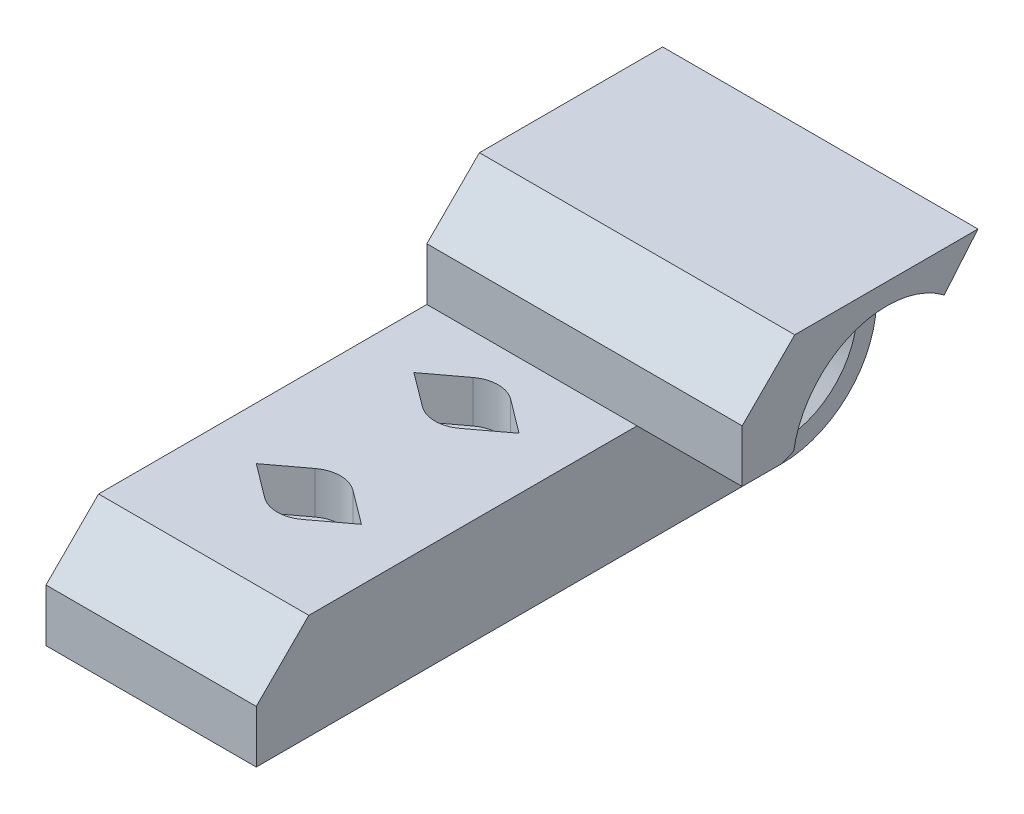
ISO-10303-21;
HEADER;
FILE_DESCRIPTION(('STEP AP214'),'2;1');
FILE_NAME('part.step','',(''),(''),'','','');
FILE_SCHEMA(('AUTOMOTIVE_DESIGN { 1 0 10303 214 1 1 1 1 }'));
ENDSEC;
DATA;
#1=APPLICATION_CONTEXT('core data for automotive mechanical design processes');
#2=APPLICATION_PROTOCOL_DEFINITION('international standard','automotive_design',2000,#1);
#3=PRODUCT_CONTEXT('',#1,'mechanical');
#4=PRODUCT('Part','Part','',(#3));
#5=PRODUCT_RELATED_PRODUCT_CATEGORY('part','',(#4));
#6=PRODUCT_DEFINITION_FORMATION('','',#4);
#7=PRODUCT_DEFINITION_CONTEXT('part definition',#1,'design');
#8=PRODUCT_DEFINITION('design','',#6,#7);
#9=PRODUCT_DEFINITION_SHAPE('','',#8);
#10=(LENGTH_UNIT() NAMED_UNIT(*) SI_UNIT(.MILLI.,.METRE.));
#11=(NAMED_UNIT(*) PLANE_ANGLE_UNIT() SI_UNIT($,.RADIAN.));
#12=(NAMED_UNIT(*) SI_UNIT($,.STERADIAN.) SOLID_ANGLE_UNIT());
#13=UNCERTAINTY_MEASURE_WITH_UNIT(LENGTH_MEASURE(1.E-05),#10,'distance_accuracy_value','');
#14=(GEOMETRIC_REPRESENTATION_CONTEXT(3) GLOBAL_UNCERTAINTY_ASSIGNED_CONTEXT((#13)) GLOBAL_UNIT_ASSIGNED_CONTEXT((#10,
#11,#12)) REPRESENTATION_CONTEXT('',''));
#15=CARTESIAN_POINT('',(0.,0.,0.));
#16=DIRECTION('',(0.,0.,1.));
#17=DIRECTION('',(1.,0.,0.));
#18=AXIS2_PLACEMENT_3D('',#15,#16,#17);
#19=CARTESIAN_POINT('',(-10.,6.,-30.));
#20=DIRECTION('',(0.,1.,0.));
#21=DIRECTION('',(0.,0.,1.));
#22=AXIS2_PLACEMENT_3D('',#19,#20,#21);
#23=CYLINDRICAL_SURFACE('',#22,3.);
#24=DIRECTION('',(0.,1.,0.));
#25=VECTOR('',#24,1.);
#26=CARTESIAN_POINT('',(-11.8,-5.6619037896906,-27.6));
#27=LINE('',#26,#25);
#28=CARTESIAN_POINT('',(-11.8,6.,-27.6));
#29=VERTEX_POINT('',#28);
#30=CARTESIAN_POINT('',(-11.8,10.,-27.6));
#31=VERTEX_POINT('',#30);
#32=EDGE_CURVE('E199',#29,#31,#27,.T.);
#33=ORIENTED_EDGE('',*,*,#32,.T.);
#34=CARTESIAN_POINT('',(-10.,10.,-30.));
#35=DIRECTION('',(0.,1.,0.));
#36=DIRECTION('',(0.,0.,1.));
#37=AXIS2_PLACEMENT_3D('',#34,#35,#36);
#38=CIRCLE('',#37,3.);
#39=CARTESIAN_POINT('',(-8.2,10.,-27.6));
#40=VERTEX_POINT('',#39);
#41=EDGE_CURVE('E214',#31,#40,#38,.T.);
#42=ORIENTED_EDGE('',*,*,#41,.T.);
#43=DIRECTION('',(0.,1.,0.));
#44=VECTOR('',#43,1.);
#45=CARTESIAN_POINT('',(-8.2,-5.6619037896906,-27.6));
#46=LINE('',#45,#44);
#47=CARTESIAN_POINT('',(-8.2,6.,-27.6));
#48=VERTEX_POINT('',#47);
#49=EDGE_CURVE('E217',#48,#40,#46,.T.);
#50=ORIENTED_EDGE('',*,*,#49,.F.);
#51=CARTESIAN_POINT('',(-10.,6.,-30.));
#52=DIRECTION('',(0.,1.,0.));
#53=DIRECTION('',(0.,0.,1.));
#54=AXIS2_PLACEMENT_3D('',#51,#52,#53);
#55=CIRCLE('',#54,3.);
#56=EDGE_CURVE('E216',#29,#48,#55,.T.);
#57=ORIENTED_EDGE('',*,*,#56,.F.);
#58=EDGE_LOOP('',(#33,#42,#50,#57));
#59=FACE_BOUND('',#58,.T.);
#60=ADVANCED_FACE('F38',(#59),#23,.F.);
#61=CARTESIAN_POINT('',(-8.20000000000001,10.,-32.4));
#62=VERTEX_POINT('',#61);
#63=CARTESIAN_POINT('',(-11.8,10.,-32.4));
#64=VERTEX_POINT('',#63);
#65=EDGE_CURVE('E225',#62,#64,#38,.T.);
#66=ORIENTED_EDGE('',*,*,#65,.T.);
#67=DIRECTION('',(0.,1.,0.));
#68=VECTOR('',#67,1.);
#69=CARTESIAN_POINT('',(-11.8,-5.6619037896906,-32.4));
#70=LINE('',#69,#68);
#71=CARTESIAN_POINT('',(-11.8,6.,-32.4));
#72=VERTEX_POINT('',#71);
#73=EDGE_CURVE('E476',#72,#64,#70,.T.);
#74=ORIENTED_EDGE('',*,*,#73,.F.);
#75=CARTESIAN_POINT('',(-8.2,6.,-32.4));
#76=VERTEX_POINT('',#75);
#77=EDGE_CURVE('E292',#76,#72,#55,.T.);
#78=ORIENTED_EDGE('',*,*,#77,.F.);
#79=DIRECTION('',(0.,1.,0.));
#80=VECTOR('',#79,1.);
#81=CARTESIAN_POINT('',(-8.20000000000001,-5.6619037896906,-32.4));
#82=LINE('',#81,#80);
#83=EDGE_CURVE('E485',#76,#62,#82,.T.);
#84=ORIENTED_EDGE('',*,*,#83,.T.);
#85=EDGE_LOOP('',(#66,#74,#78,#84));
#86=FACE_BOUND('',#85,.T.);
#87=ADVANCED_FACE('F362',(#86),#23,.F.);
#88=CARTESIAN_POINT('',(-10.,6.,-15.));
#89=DIRECTION('',(0.,1.,0.));
#90=DIRECTION('',(0.,0.,1.));
#91=AXIS2_PLACEMENT_3D('',#88,#89,#90);
#92=CYLINDRICAL_SURFACE('',#91,3.);
#93=DIRECTION('',(0.,1.,0.));
#94=VECTOR('',#93,1.);
#95=CARTESIAN_POINT('',(-8.2,-5.6619037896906,-17.4));
#96=LINE('',#95,#94);
#97=CARTESIAN_POINT('',(-8.2,6.,-17.4));
#98=VERTEX_POINT('',#97);
#99=CARTESIAN_POINT('',(-8.2,10.,-17.4));
#100=VERTEX_POINT('',#99);
#101=EDGE_CURVE('E509',#98,#100,#96,.T.);
#102=ORIENTED_EDGE('',*,*,#101,.T.);
#103=CARTESIAN_POINT('',(-10.,10.,-15.));
#104=DIRECTION('',(0.,1.,0.));
#105=DIRECTION('',(0.,0.,1.));
#106=AXIS2_PLACEMENT_3D('',#103,#104,#105);
#107=CIRCLE('',#106,3.);
#108=CARTESIAN_POINT('',(-11.8,10.,-17.4));
#109=VERTEX_POINT('',#108);
#110=EDGE_CURVE('E236',#100,#109,#107,.T.);
#111=ORIENTED_EDGE('',*,*,#110,.T.);
#112=DIRECTION('',(0.,1.,0.));
#113=VECTOR('',#112,1.);
#114=CARTESIAN_POINT('',(-11.8,-5.6619037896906,-17.4));
#115=LINE('',#114,#113);
#116=CARTESIAN_POINT('',(-11.8,6.,-17.4));
#117=VERTEX_POINT('',#116);
#118=EDGE_CURVE('E523',#117,#109,#115,.T.);
#119=ORIENTED_EDGE('',*,*,#118,.F.);
#120=CARTESIAN_POINT('',(-10.,6.,-15.));
#121=DIRECTION('',(0.,1.,0.));
#122=DIRECTION('',(0.,0.,1.));
#123=AXIS2_PLACEMENT_3D('',#120,#121,#122);
#124=CIRCLE('',#123,3.);
#125=EDGE_CURVE('E226',#98,#117,#124,.T.);
#126=ORIENTED_EDGE('',*,*,#125,.F.);
#127=EDGE_LOOP('',(#102,#111,#119,#126));
#128=FACE_BOUND('',#127,.T.);
#129=ADVANCED_FACE('F367',(#128),#92,.F.);
#130=CARTESIAN_POINT('',(-11.8,10.,-12.6));
#131=VERTEX_POINT('',#130);
#132=CARTESIAN_POINT('',(-8.2,10.,-12.6));
#133=VERTEX_POINT('',#132);
#134=EDGE_CURVE('E237',#131,#133,#107,.T.);
#135=ORIENTED_EDGE('',*,*,#134,.T.);
#136=DIRECTION('',(0.,1.,0.));
#137=VECTOR('',#136,1.);
#138=CARTESIAN_POINT('',(-8.2,-5.6619037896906,-12.6));
#139=LINE('',#138,#137);
#140=CARTESIAN_POINT('',(-8.2,6.,-12.6));
#141=VERTEX_POINT('',#140);
#142=EDGE_CURVE('E528',#141,#133,#139,.T.);
#143=ORIENTED_EDGE('',*,*,#142,.F.);
#144=CARTESIAN_POINT('',(-11.8,6.,-12.6));
#145=VERTEX_POINT('',#144);
#146=EDGE_CURVE('E230',#145,#141,#124,.T.);
#147=ORIENTED_EDGE('',*,*,#146,.F.);
#148=DIRECTION('',(0.,1.,0.));
#149=VECTOR('',#148,1.);
#150=CARTESIAN_POINT('',(-11.8,-5.6619037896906,-12.6));
#151=LINE('',#150,#149);
#152=EDGE_CURVE('E530',#145,#131,#151,.T.);
#153=ORIENTED_EDGE('',*,*,#152,.T.);
#154=EDGE_LOOP('',(#135,#143,#147,#153));
#155=FACE_BOUND('',#154,.T.);
#156=ADVANCED_FACE('F372',(#155),#92,.F.);
#157=CARTESIAN_POINT('',(-10.,-0.000999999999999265,-15.));
#158=DIRECTION('',(0.,1.,0.));
#159=DIRECTION('',(0.,0.,1.));
#160=AXIS2_PLACEMENT_3D('',#157,#158,#159);
#161=CYLINDRICAL_SURFACE('',#160,1.75);
#162=CARTESIAN_POINT('',(-10.,0.,-15.));
#163=DIRECTION('',(0.,-1.,0.));
#164=DIRECTION('',(0.,0.,-1.));
#165=AXIS2_PLACEMENT_3D('',#162,#163,#164);
#166=CIRCLE('',#165,1.75);
#167=CARTESIAN_POINT('',(-10.,0.,-16.75));
#168=VERTEX_POINT('',#167);
#169=EDGE_CURVE('E245',#168,#168,#166,.F.);
#170=ORIENTED_EDGE('',*,*,#169,.F.);
#171=EDGE_LOOP('',(#170));
#172=FACE_BOUND('',#171,.T.);
#173=CARTESIAN_POINT('',(-10.,6.,-15.));
#174=DIRECTION('',(0.,1.,0.));
#175=DIRECTION('',(0.,0.,1.));
#176=AXIS2_PLACEMENT_3D('',#173,#174,#175);
#177=CIRCLE('',#176,1.75);
#178=CARTESIAN_POINT('',(-10.,6.,-13.25));
#179=VERTEX_POINT('',#178);
#180=EDGE_CURVE('E248',#179,#179,#177,.F.);
#181=ORIENTED_EDGE('',*,*,#180,.F.);
#182=EDGE_LOOP('',(#181));
#183=FACE_BOUND('',#182,.T.);
#184=ADVANCED_FACE('F378',(#172,#183),#161,.F.);
#185=CARTESIAN_POINT('',(-10.,-0.000999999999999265,-30.));
#186=DIRECTION('',(0.,1.,0.));
#187=DIRECTION('',(0.,0.,1.));
#188=AXIS2_PLACEMENT_3D('',#185,#186,#187);
#189=CYLINDRICAL_SURFACE('',#188,1.75);
#190=CARTESIAN_POINT('',(-10.,0.,-30.));
#191=DIRECTION('',(0.,-1.,0.));
#192=DIRECTION('',(0.,0.,-1.));
#193=AXIS2_PLACEMENT_3D('',#190,#191,#192);
#194=CIRCLE('',#193,1.75);
#195=CARTESIAN_POINT('',(-10.,0.,-31.75));
#196=VERTEX_POINT('',#195);
#197=EDGE_CURVE('E241',#196,#196,#194,.F.);
#198=ORIENTED_EDGE('',*,*,#197,.F.);
#199=EDGE_LOOP('',(#198));
#200=FACE_BOUND('',#199,.T.);
#201=CARTESIAN_POINT('',(-10.,6.,-30.));
#202=DIRECTION('',(0.,1.,0.));
#203=DIRECTION('',(0.,0.,1.));
#204=AXIS2_PLACEMENT_3D('',#201,#202,#203);
#205=CIRCLE('',#204,1.75);
#206=CARTESIAN_POINT('',(-10.,6.,-28.25));
#207=VERTEX_POINT('',#206);
#208=EDGE_CURVE('E289',#207,#207,#205,.F.);
#209=ORIENTED_EDGE('',*,*,#208,.F.);
#210=EDGE_LOOP('',(#209));
#211=FACE_BOUND('',#210,.T.);
#212=ADVANCED_FACE('F374',(#200,#211),#189,.F.);
#213=CARTESIAN_POINT('',(-20.,5.,0.));
#214=DIRECTION('',(0.,0.,1.));
#215=DIRECTION('',(1.,0.,0.));
#216=AXIS2_PLACEMENT_3D('',#213,#214,#215);
#217=PLANE('',#216);
#218=DIRECTION('',(0.,-1.,0.));
#219=VECTOR('',#218,1.);
#220=CARTESIAN_POINT('',(0.,5.,0.));
#221=LINE('',#220,#219);
#222=CARTESIAN_POINT('',(0.,5.,0.));
#223=VERTEX_POINT('',#222);
#224=CARTESIAN_POINT('',(0.,0.,0.));
#225=VERTEX_POINT('',#224);
#226=EDGE_CURVE('E244',#223,#225,#221,.T.);
#227=ORIENTED_EDGE('',*,*,#226,.F.);
#228=DIRECTION('',(1.,0.,0.));
#229=VECTOR('',#228,1.);
#230=CARTESIAN_POINT('',(-20.,5.,0.));
#231=LINE('',#230,#229);
#232=CARTESIAN_POINT('',(-20.,5.,0.));
#233=VERTEX_POINT('',#232);
#234=EDGE_CURVE('E280',#233,#223,#231,.T.);
#235=ORIENTED_EDGE('',*,*,#234,.F.);
#236=DIRECTION('',(0.,-1.,0.));
#237=VECTOR('',#236,1.);
#238=CARTESIAN_POINT('',(-20.,5.,0.));
#239=LINE('',#238,#237);
#240=CARTESIAN_POINT('',(-20.,0.,0.));
#241=VERTEX_POINT('',#240);
#242=EDGE_CURVE('E249',#233,#241,#239,.T.);
#243=ORIENTED_EDGE('',*,*,#242,.T.);
#244=DIRECTION('',(1.,0.,0.));
#245=VECTOR('',#244,1.);
#246=CARTESIAN_POINT('',(-20.,0.,0.));
#247=LINE('',#246,#245);
#248=EDGE_CURVE('E264',#241,#225,#247,.T.);
#249=ORIENTED_EDGE('',*,*,#248,.T.);
#250=EDGE_LOOP('',(#227,#235,#243,#249));
#251=FACE_BOUND('',#250,.T.);
#252=ADVANCED_FACE('F377',(#251),#217,.T.);
#253=CARTESIAN_POINT('',(-20.,5.,0.));
#254=DIRECTION('',(0.,0.707106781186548,0.707106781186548));
#255=DIRECTION('',(0.,-0.707106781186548,0.707106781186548));
#256=AXIS2_PLACEMENT_3D('',#253,#254,#255);
#257=PLANE('',#256);
#258=DIRECTION('',(0.,-0.707106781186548,0.707106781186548));
#259=VECTOR('',#258,1.);
#260=CARTESIAN_POINT('',(0.,5.,0.));
#261=LINE('',#260,#259);
#262=CARTESIAN_POINT('',(0.,10.,-5.));
#263=VERTEX_POINT('',#262);
#264=EDGE_CURVE('E253',#263,#223,#261,.T.);
#265=ORIENTED_EDGE('',*,*,#264,.F.);
#266=DIRECTION('',(1.,0.,0.));
#267=VECTOR('',#266,1.);
#268=CARTESIAN_POINT('',(-20.,10.,-5.));
#269=LINE('',#268,#267);
#270=CARTESIAN_POINT('',(-20.,10.,-5.));
#271=VERTEX_POINT('',#270);
#272=EDGE_CURVE('E283',#271,#263,#269,.T.);
#273=ORIENTED_EDGE('',*,*,#272,.F.);
#274=DIRECTION('',(0.,-0.707106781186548,0.707106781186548));
#275=VECTOR('',#274,1.);
#276=CARTESIAN_POINT('',(-20.,5.,0.));
#277=LINE('',#276,#275);
#278=EDGE_CURVE('E261',#271,#233,#277,.T.);
#279=ORIENTED_EDGE('',*,*,#278,.T.);
#280=ORIENTED_EDGE('',*,*,#234,.T.);
#281=EDGE_LOOP('',(#265,#273,#279,#280));
#282=FACE_BOUND('',#281,.T.);
#283=ADVANCED_FACE('F390',(#282),#257,.T.);
#284=CARTESIAN_POINT('',(-20.,10.,-40.));
#285=DIRECTION('',(0.,1.,0.));
#286=DIRECTION('',(0.,0.,1.));
#287=AXIS2_PLACEMENT_3D('',#284,#285,#286);
#288=PLANE('',#287);
#289=DIRECTION('',(0.8,0.,0.6));
#290=VECTOR('',#289,1.);
#291=CARTESIAN_POINT('',(-15.,10.,-30.));
#292=LINE('',#291,#290);
#293=CARTESIAN_POINT('',(-15.,10.,-30.));
#294=VERTEX_POINT('',#293);
#295=EDGE_CURVE('E196',#294,#31,#292,.T.);
#296=ORIENTED_EDGE('',*,*,#295,.F.);
#297=DIRECTION('',(-0.8,0.,0.6));
#298=VECTOR('',#297,1.);
#299=CARTESIAN_POINT('',(-15.,10.,-30.));
#300=LINE('',#299,#298);
#301=EDGE_CURVE('E218',#64,#294,#300,.T.);
#302=ORIENTED_EDGE('',*,*,#301,.F.);
#303=ORIENTED_EDGE('',*,*,#65,.F.);
#304=DIRECTION('',(-0.800000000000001,0.,-0.599999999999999));
#305=VECTOR('',#304,1.);
#306=CARTESIAN_POINT('',(-5.,10.,-30.));
#307=LINE('',#306,#305);
#308=CARTESIAN_POINT('',(-5.,10.,-30.));
#309=VERTEX_POINT('',#308);
#310=EDGE_CURVE('E498',#309,#62,#307,.T.);
#311=ORIENTED_EDGE('',*,*,#310,.F.);
#312=DIRECTION('',(0.8,0.,-0.6));
#313=VECTOR('',#312,1.);
#314=CARTESIAN_POINT('',(-5.,10.,-30.));
#315=LINE('',#314,#313);
#316=EDGE_CURVE('E207',#40,#309,#315,.T.);
#317=ORIENTED_EDGE('',*,*,#316,.F.);
#318=ORIENTED_EDGE('',*,*,#41,.F.);
#319=EDGE_LOOP('',(#296,#302,#303,#311,#317,#318));
#320=FACE_BOUND('',#319,.T.);
#321=DIRECTION('',(-0.8,0.,-0.6));
#322=VECTOR('',#321,1.);
#323=CARTESIAN_POINT('',(-5.,10.,-15.));
#324=LINE('',#323,#322);
#325=CARTESIAN_POINT('',(-5.,10.,-15.));
#326=VERTEX_POINT('',#325);
#327=EDGE_CURVE('E521',#326,#100,#324,.T.);
#328=ORIENTED_EDGE('',*,*,#327,.F.);
#329=DIRECTION('',(0.800000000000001,0.,-0.599999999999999));
#330=VECTOR('',#329,1.);
#331=CARTESIAN_POINT('',(-5.,10.,-15.));
#332=LINE('',#331,#330);
#333=EDGE_CURVE('E518',#133,#326,#332,.T.);
#334=ORIENTED_EDGE('',*,*,#333,.F.);
#335=ORIENTED_EDGE('',*,*,#134,.F.);
#336=DIRECTION('',(0.8,0.,0.6));
#337=VECTOR('',#336,1.);
#338=CARTESIAN_POINT('',(-15.,10.,-15.));
#339=LINE('',#338,#337);
#340=CARTESIAN_POINT('',(-15.,10.,-15.));
#341=VERTEX_POINT('',#340);
#342=EDGE_CURVE('E516',#341,#131,#339,.T.);
#343=ORIENTED_EDGE('',*,*,#342,.F.);
#344=DIRECTION('',(-0.8,0.,0.6));
#345=VECTOR('',#344,1.);
#346=CARTESIAN_POINT('',(-15.,10.,-15.));
#347=LINE('',#346,#345);
#348=EDGE_CURVE('E513',#109,#341,#347,.T.);
#349=ORIENTED_EDGE('',*,*,#348,.F.);
#350=ORIENTED_EDGE('',*,*,#110,.F.);
#351=EDGE_LOOP('',(#328,#334,#335,#343,#349,#350));
#352=FACE_BOUND('',#351,.T.);
#353=DIRECTION('',(-1.,0.,0.));
#354=VECTOR('',#353,1.);
#355=CARTESIAN_POINT('',(10.,10.,-36.2250356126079));
#356=LINE('',#355,#354);
#357=CARTESIAN_POINT('',(0.,10.,-36.2250356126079));
#358=VERTEX_POINT('',#357);
#359=CARTESIAN_POINT('',(-20.,10.,-36.2250356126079));
#360=VERTEX_POINT('',#359);
#361=EDGE_CURVE('E332',#358,#360,#356,.T.);
#362=ORIENTED_EDGE('',*,*,#361,.T.);
#363=DIRECTION('',(0.,0.,1.));
#364=VECTOR('',#363,1.);
#365=CARTESIAN_POINT('',(-20.,10.,-40.));
#366=LINE('',#365,#364);
#367=EDGE_CURVE('E259',#360,#271,#366,.T.);
#368=ORIENTED_EDGE('',*,*,#367,.T.);
#369=ORIENTED_EDGE('',*,*,#272,.T.);
#370=DIRECTION('',(0.,0.,1.));
#371=VECTOR('',#370,1.);
#372=CARTESIAN_POINT('',(0.,10.,-40.));
#373=LINE('',#372,#371);
#374=EDGE_CURVE('E274',#358,#263,#373,.T.);
#375=ORIENTED_EDGE('',*,*,#374,.F.);
#376=EDGE_LOOP('',(#362,#368,#369,#375));
#377=FACE_BOUND('',#376,.T.);
#378=ADVANCED_FACE('F221',(#320,#352,#377),#288,.T.);
#379=CARTESIAN_POINT('',(-20.,9.,-50.));
#380=DIRECTION('',(1.,0.,0.));
#381=DIRECTION('',(0.,0.,-1.));
#382=AXIS2_PLACEMENT_3D('',#379,#380,#381);
#383=CYLINDRICAL_SURFACE('',#382,9.);
#384=DIRECTION('',(-1.,0.,0.));
#385=VECTOR('',#384,1.);
#386=CARTESIAN_POINT('',(10.,16.1697777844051,-55.4400630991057));
#387=LINE('',#386,#385);
#388=CARTESIAN_POINT('',(0.,16.1697777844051,-55.4400630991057));
#389=VERTEX_POINT('',#388);
#390=CARTESIAN_POINT('',(-20.,16.1697777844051,-55.4400630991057));
#391=VERTEX_POINT('',#390);
#392=EDGE_CURVE('E338',#389,#391,#387,.T.);
#393=ORIENTED_EDGE('',*,*,#392,.F.);
#394=CARTESIAN_POINT('',(0.,9.,-50.));
#395=DIRECTION('',(1.,0.,0.));
#396=DIRECTION('',(0.,0.,-1.));
#397=AXIS2_PLACEMENT_3D('',#394,#395,#396);
#398=CIRCLE('',#397,9.);
#399=CARTESIAN_POINT('',(0.,0.,-50.));
#400=VERTEX_POINT('',#399);
#401=EDGE_CURVE('E271',#400,#389,#398,.T.);
#402=ORIENTED_EDGE('',*,*,#401,.F.);
#403=DIRECTION('',(1.,0.,0.));
#404=VECTOR('',#403,1.);
#405=CARTESIAN_POINT('',(-20.,0.,-50.));
#406=LINE('',#405,#404);
#407=CARTESIAN_POINT('',(-20.,0.,-50.));
#408=VERTEX_POINT('',#407);
#409=EDGE_CURVE('E286',#408,#400,#406,.T.);
#410=ORIENTED_EDGE('',*,*,#409,.F.);
#411=CARTESIAN_POINT('',(-20.,9.,-50.));
#412=DIRECTION('',(1.,0.,0.));
#413=DIRECTION('',(0.,0.,-1.));
#414=AXIS2_PLACEMENT_3D('',#411,#412,#413);
#415=CIRCLE('',#414,9.);
#416=EDGE_CURVE('E256',#408,#391,#415,.T.);
#417=ORIENTED_EDGE('',*,*,#416,.T.);
#418=EDGE_LOOP('',(#393,#402,#410,#417));
#419=FACE_BOUND('',#418,.T.);
#420=ADVANCED_FACE('F396',(#419),#383,.T.);
#421=CARTESIAN_POINT('',(-20.,0.,0.));
#422=DIRECTION('',(0.,-1.,0.));
#423=DIRECTION('',(0.,0.,-1.));
#424=AXIS2_PLACEMENT_3D('',#421,#422,#423);
#425=PLANE('',#424);
#426=ORIENTED_EDGE('',*,*,#197,.T.);
#427=EDGE_LOOP('',(#426));
#428=FACE_BOUND('',#427,.T.);
#429=ORIENTED_EDGE('',*,*,#169,.T.);
#430=EDGE_LOOP('',(#429));
#431=FACE_BOUND('',#430,.T.);
#432=DIRECTION('',(0.,0.,-1.));
#433=VECTOR('',#432,1.);
#434=CARTESIAN_POINT('',(0.,0.,0.));
#435=LINE('',#434,#433);
#436=EDGE_CURVE('E267',#225,#400,#435,.T.);
#437=ORIENTED_EDGE('',*,*,#436,.F.);
#438=ORIENTED_EDGE('',*,*,#248,.F.);
#439=DIRECTION('',(0.,0.,-1.));
#440=VECTOR('',#439,1.);
#441=CARTESIAN_POINT('',(-20.,0.,0.));
#442=LINE('',#441,#440);
#443=EDGE_CURVE('E252',#241,#408,#442,.T.);
#444=ORIENTED_EDGE('',*,*,#443,.T.);
#445=ORIENTED_EDGE('',*,*,#409,.T.);
#446=EDGE_LOOP('',(#437,#438,#444,#445));
#447=FACE_BOUND('',#446,.T.);
#448=ADVANCED_FACE('F386',(#428,#431,#447),#425,.T.);
#449=CARTESIAN_POINT('',(-20.,9.,-50.));
#450=DIRECTION('',(1.,0.,0.));
#451=DIRECTION('',(0.,0.,-1.));
#452=AXIS2_PLACEMENT_3D('',#449,#450,#451);
#453=PLANE('',#452);
#454=DIRECTION('',(0.,1.,0.));
#455=VECTOR('',#454,1.);
#456=CARTESIAN_POINT('',(-20.,10.,-36.2250356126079));
#457=LINE('',#456,#455);
#458=CARTESIAN_POINT('',(-20.,15.,-36.2250356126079));
#459=VERTEX_POINT('',#458);
#460=EDGE_CURVE('E307',#360,#459,#457,.T.);
#461=ORIENTED_EDGE('',*,*,#460,.T.);
#462=DIRECTION('',(0.,-0.707106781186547,0.707106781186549));
#463=VECTOR('',#462,1.);
#464=CARTESIAN_POINT('',(-20.,15.,-36.2250356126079));
#465=LINE('',#464,#463);
#466=CARTESIAN_POINT('',(-20.,20.,-41.2250356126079));
#467=VERTEX_POINT('',#466);
#468=EDGE_CURVE('E60',#459,#467,#465,.F.);
#469=ORIENTED_EDGE('',*,*,#468,.T.);
#470=DIRECTION('',(0.,0.,-1.));
#471=VECTOR('',#470,1.);
#472=CARTESIAN_POINT('',(-20.,20.,-36.2250356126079));
#473=LINE('',#472,#471);
#474=CARTESIAN_POINT('',(-20.,20.,-58.6540011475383));
#475=VERTEX_POINT('',#474);
#476=EDGE_CURVE('E316',#467,#475,#473,.T.);
#477=ORIENTED_EDGE('',*,*,#476,.T.);
#478=DIRECTION('',(0.,-0.766044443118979,0.642787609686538));
#479=VECTOR('',#478,1.);
#480=CARTESIAN_POINT('',(-20.,20.,-58.6540011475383));
#481=LINE('',#480,#479);
#482=EDGE_CURVE('E319',#475,#391,#481,.T.);
#483=ORIENTED_EDGE('',*,*,#482,.T.);
#484=ORIENTED_EDGE('',*,*,#416,.F.);
#485=ORIENTED_EDGE('',*,*,#443,.F.);
#486=ORIENTED_EDGE('',*,*,#242,.F.);
#487=ORIENTED_EDGE('',*,*,#278,.F.);
#488=ORIENTED_EDGE('',*,*,#367,.F.);
#489=EDGE_LOOP('',(#461,#469,#477,#483,#484,#485,#486,#487,#488));
#490=FACE_BOUND('',#489,.T.);
#491=ADVANCED_FACE('F314',(#490),#453,.F.);
#492=CARTESIAN_POINT('',(0.,9.,-50.));
#493=DIRECTION('',(1.,0.,0.));
#494=DIRECTION('',(0.,0.,-1.));
#495=AXIS2_PLACEMENT_3D('',#492,#493,#494);
#496=PLANE('',#495);
#497=DIRECTION('',(0.,0.378041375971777,-0.925788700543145));
#498=VECTOR('',#497,1.);
#499=CARTESIAN_POINT('',(0.,10.,-40.));
#500=LINE('',#499,#498);
#501=CARTESIAN_POINT('',(0.,10.,-40.));
#502=VERTEX_POINT('',#501);
#503=CARTESIAN_POINT('',(0.,10.4568108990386,-41.1186880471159));
#504=VERTEX_POINT('',#503);
#505=EDGE_CURVE('E317',#502,#504,#500,.T.);
#506=ORIENTED_EDGE('',*,*,#505,.F.);
#507=EDGE_CURVE('E275',#502,#358,#373,.T.);
#508=ORIENTED_EDGE('',*,*,#507,.T.);
#509=ORIENTED_EDGE('',*,*,#374,.T.);
#510=ORIENTED_EDGE('',*,*,#264,.T.);
#511=ORIENTED_EDGE('',*,*,#226,.T.);
#512=ORIENTED_EDGE('',*,*,#436,.T.);
#513=ORIENTED_EDGE('',*,*,#401,.T.);
#514=EDGE_CURVE('E270',#389,#504,#398,.T.);
#515=ORIENTED_EDGE('',*,*,#514,.T.);
#516=EDGE_LOOP('',(#506,#508,#509,#510,#511,#512,#513,#515));
#517=FACE_BOUND('',#516,.T.);
#518=CARTESIAN_POINT('',(0.,9.,-50.));
#519=DIRECTION('',(1.,0.,0.));
#520=DIRECTION('',(0.,0.,-1.));
#521=AXIS2_PLACEMENT_3D('',#518,#519,#520);
#522=CIRCLE('',#521,7.15000000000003);
#523=CARTESIAN_POINT('',(0.,9.,-57.15));
#524=VERTEX_POINT('',#523);
#525=EDGE_CURVE('E297',#524,#524,#522,.F.);
#526=ORIENTED_EDGE('',*,*,#525,.T.);
#527=EDGE_LOOP('',(#526));
#528=FACE_BOUND('',#527,.T.);
#529=ADVANCED_FACE('F385',(#517,#528),#496,.T.);
#530=CARTESIAN_POINT('',(-10.,6.,-30.));
#531=DIRECTION('',(0.,1.,0.));
#532=DIRECTION('',(0.,0.,1.));
#533=AXIS2_PLACEMENT_3D('',#530,#531,#532);
#534=PLANE('',#533);
#535=ORIENTED_EDGE('',*,*,#56,.T.);
#536=DIRECTION('',(-0.8,0.,0.6));
#537=VECTOR('',#536,1.);
#538=CARTESIAN_POINT('',(-5.,6.,-30.));
#539=LINE('',#538,#537);
#540=CARTESIAN_POINT('',(-5.,6.,-30.));
#541=VERTEX_POINT('',#540);
#542=EDGE_CURVE('E490',#541,#48,#539,.T.);
#543=ORIENTED_EDGE('',*,*,#542,.F.);
#544=DIRECTION('',(0.800000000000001,0.,0.599999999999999));
#545=VECTOR('',#544,1.);
#546=CARTESIAN_POINT('',(-5.,6.,-30.));
#547=LINE('',#546,#545);
#548=EDGE_CURVE('E480',#76,#541,#547,.T.);
#549=ORIENTED_EDGE('',*,*,#548,.F.);
#550=ORIENTED_EDGE('',*,*,#77,.T.);
#551=DIRECTION('',(0.8,0.,-0.6));
#552=VECTOR('',#551,1.);
#553=CARTESIAN_POINT('',(-15.,6.,-30.));
#554=LINE('',#553,#552);
#555=CARTESIAN_POINT('',(-15.,6.,-30.));
#556=VERTEX_POINT('',#555);
#557=EDGE_CURVE('E474',#556,#72,#554,.T.);
#558=ORIENTED_EDGE('',*,*,#557,.F.);
#559=DIRECTION('',(-0.8,0.,-0.6));
#560=VECTOR('',#559,1.);
#561=CARTESIAN_POINT('',(-15.,6.,-30.));
#562=LINE('',#561,#560);
#563=EDGE_CURVE('E479',#29,#556,#562,.T.);
#564=ORIENTED_EDGE('',*,*,#563,.F.);
#565=EDGE_LOOP('',(#535,#543,#549,#550,#558,#564));
#566=FACE_BOUND('',#565,.T.);
#567=ORIENTED_EDGE('',*,*,#208,.T.);
#568=EDGE_LOOP('',(#567));
#569=FACE_BOUND('',#568,.T.);
#570=ADVANCED_FACE('F357',(#566,#569),#534,.T.);
#571=CARTESIAN_POINT('',(-10.,6.,-15.));
#572=DIRECTION('',(0.,1.,0.));
#573=DIRECTION('',(0.,0.,1.));
#574=AXIS2_PLACEMENT_3D('',#571,#572,#573);
#575=PLANE('',#574);
#576=ORIENTED_EDGE('',*,*,#146,.T.);
#577=DIRECTION('',(-0.800000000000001,0.,0.599999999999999));
#578=VECTOR('',#577,1.);
#579=CARTESIAN_POINT('',(-5.,6.,-15.));
#580=LINE('',#579,#578);
#581=CARTESIAN_POINT('',(-5.,6.,-15.));
#582=VERTEX_POINT('',#581);
#583=EDGE_CURVE('E508',#582,#141,#580,.T.);
#584=ORIENTED_EDGE('',*,*,#583,.F.);
#585=DIRECTION('',(0.8,0.,0.6));
#586=VECTOR('',#585,1.);
#587=CARTESIAN_POINT('',(-5.,6.,-15.));
#588=LINE('',#587,#586);
#589=EDGE_CURVE('E511',#98,#582,#588,.T.);
#590=ORIENTED_EDGE('',*,*,#589,.F.);
#591=ORIENTED_EDGE('',*,*,#125,.T.);
#592=DIRECTION('',(0.8,0.,-0.6));
#593=VECTOR('',#592,1.);
#594=CARTESIAN_POINT('',(-15.,6.,-15.));
#595=LINE('',#594,#593);
#596=CARTESIAN_POINT('',(-15.,6.,-15.));
#597=VERTEX_POINT('',#596);
#598=EDGE_CURVE('E208',#597,#117,#595,.T.);
#599=ORIENTED_EDGE('',*,*,#598,.F.);
#600=DIRECTION('',(-0.8,0.,-0.6));
#601=VECTOR('',#600,1.);
#602=CARTESIAN_POINT('',(-15.,6.,-15.));
#603=LINE('',#602,#601);
#604=EDGE_CURVE('E506',#145,#597,#603,.T.);
#605=ORIENTED_EDGE('',*,*,#604,.F.);
#606=EDGE_LOOP('',(#576,#584,#590,#591,#599,#605));
#607=FACE_BOUND('',#606,.T.);
#608=ORIENTED_EDGE('',*,*,#180,.T.);
#609=EDGE_LOOP('',(#608));
#610=FACE_BOUND('',#609,.T.);
#611=ADVANCED_FACE('F348',(#607,#610),#575,.T.);
#612=CARTESIAN_POINT('',(-13.,9.,-50.));
#613=DIRECTION('',(1.,0.,0.));
#614=DIRECTION('',(0.,0.,-1.));
#615=AXIS2_PLACEMENT_3D('',#612,#613,#614);
#616=CYLINDRICAL_SURFACE('',#615,6.14999999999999);
#617=CARTESIAN_POINT('',(-1.00000000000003,9.,-50.));
#618=DIRECTION('',(1.,0.,0.));
#619=DIRECTION('',(0.,0.,-1.));
#620=AXIS2_PLACEMENT_3D('',#617,#618,#619);
#621=CIRCLE('',#620,6.14999999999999);
#622=CARTESIAN_POINT('',(-1.00000000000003,9.,-56.15));
#623=VERTEX_POINT('',#622);
#624=EDGE_CURVE('E282',#623,#623,#621,.T.);
#625=CARTESIAN_POINT('',(-13.,9.,-50.));
#626=DIRECTION('',(1.,0.,0.));
#627=DIRECTION('',(0.,0.,-1.));
#628=AXIS2_PLACEMENT_3D('',#625,#626,#627);
#629=CIRCLE('',#628,6.14999999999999);
#630=CARTESIAN_POINT('',(-13.,9.,-56.15));
#631=VERTEX_POINT('',#630);
#632=EDGE_CURVE('E240',#631,#631,#629,.T.);
#633=CARTESIAN_POINT('',(-1.00000000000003,9.,-56.15));
#634=CARTESIAN_POINT('',(-1.12500000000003,9.,-56.15));
#635=CARTESIAN_POINT('',(-1.25000000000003,9.,-56.15));
#636=CARTESIAN_POINT('',(-1.50000000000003,9.,-56.15));
#637=CARTESIAN_POINT('',(-1.62500000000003,9.,-56.15));
#638=CARTESIAN_POINT('',(-1.87500000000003,9.,-56.15));
#639=CARTESIAN_POINT('',(-2.00000000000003,9.,-56.15));
#640=CARTESIAN_POINT('',(-2.25000000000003,9.,-56.15));
#641=CARTESIAN_POINT('',(-2.37500000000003,9.,-56.15));
#642=CARTESIAN_POINT('',(-2.62500000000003,9.,-56.15));
#643=CARTESIAN_POINT('',(-2.75000000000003,9.,-56.15));
#644=CARTESIAN_POINT('',(-3.00000000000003,9.,-56.15));
#645=CARTESIAN_POINT('',(-3.12500000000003,9.,-56.15));
#646=CARTESIAN_POINT('',(-3.37500000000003,9.,-56.15));
#647=CARTESIAN_POINT('',(-3.50000000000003,9.,-56.15));
#648=CARTESIAN_POINT('',(-3.75000000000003,9.,-56.15));
#649=CARTESIAN_POINT('',(-3.87500000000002,9.,-56.15));
#650=CARTESIAN_POINT('',(-4.12500000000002,9.,-56.15));
#651=CARTESIAN_POINT('',(-4.25000000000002,9.,-56.15));
#652=CARTESIAN_POINT('',(-4.50000000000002,9.,-56.15));
#653=CARTESIAN_POINT('',(-4.62500000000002,9.,-56.15));
#654=CARTESIAN_POINT('',(-4.87500000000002,9.,-56.15));
#655=CARTESIAN_POINT('',(-5.00000000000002,9.,-56.15));
#656=CARTESIAN_POINT('',(-5.25000000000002,9.,-56.15));
#657=CARTESIAN_POINT('',(-5.37500000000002,9.,-56.15));
#658=CARTESIAN_POINT('',(-5.62500000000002,9.,-56.15));
#659=CARTESIAN_POINT('',(-5.75000000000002,9.,-56.15));
#660=CARTESIAN_POINT('',(-6.00000000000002,9.,-56.15));
#661=CARTESIAN_POINT('',(-6.12500000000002,9.,-56.15));
#662=CARTESIAN_POINT('',(-6.37500000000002,9.,-56.15));
#663=CARTESIAN_POINT('',(-6.50000000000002,9.,-56.15));
#664=CARTESIAN_POINT('',(-6.75000000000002,9.,-56.15));
#665=CARTESIAN_POINT('',(-6.87500000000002,9.,-56.15));
#666=CARTESIAN_POINT('',(-7.12500000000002,9.,-56.15));
#667=CARTESIAN_POINT('',(-7.25000000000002,9.,-56.15));
#668=CARTESIAN_POINT('',(-7.50000000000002,9.,-56.15));
#669=CARTESIAN_POINT('',(-7.62500000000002,9.,-56.15));
#670=CARTESIAN_POINT('',(-7.87500000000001,9.,-56.15));
#671=CARTESIAN_POINT('',(-8.00000000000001,9.,-56.15));
#672=CARTESIAN_POINT('',(-8.25000000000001,9.,-56.15));
#673=CARTESIAN_POINT('',(-8.37500000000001,9.,-56.15));
#674=CARTESIAN_POINT('',(-8.62500000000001,9.,-56.15));
#675=CARTESIAN_POINT('',(-8.75000000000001,9.,-56.15));
#676=CARTESIAN_POINT('',(-9.00000000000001,9.,-56.15));
#677=CARTESIAN_POINT('',(-9.12500000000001,9.,-56.15));
#678=CARTESIAN_POINT('',(-9.37500000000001,9.,-56.15));
#679=CARTESIAN_POINT('',(-9.50000000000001,9.,-56.15));
#680=CARTESIAN_POINT('',(-9.75000000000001,9.,-56.15));
#681=CARTESIAN_POINT('',(-9.87500000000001,9.,-56.15));
#682=CARTESIAN_POINT('',(-10.125,9.,-56.15));
#683=CARTESIAN_POINT('',(-10.25,9.,-56.15));
#684=CARTESIAN_POINT('',(-10.5,9.,-56.15));
#685=CARTESIAN_POINT('',(-10.625,9.,-56.15));
#686=CARTESIAN_POINT('',(-10.875,9.,-56.15));
#687=CARTESIAN_POINT('',(-11.,9.,-56.15));
#688=CARTESIAN_POINT('',(-11.25,9.,-56.15));
#689=CARTESIAN_POINT('',(-11.375,9.,-56.15));
#690=CARTESIAN_POINT('',(-11.625,9.,-56.15));
#691=CARTESIAN_POINT('',(-11.75,9.,-56.15));
#692=CARTESIAN_POINT('',(-12.,9.,-56.15));
#693=CARTESIAN_POINT('',(-12.125,9.,-56.15));
#694=CARTESIAN_POINT('',(-12.375,9.,-56.15));
#695=CARTESIAN_POINT('',(-12.5,9.,-56.15));
#696=CARTESIAN_POINT('',(-12.75,9.,-56.15));
#697=CARTESIAN_POINT('',(-12.875,9.,-56.15));
#698=CARTESIAN_POINT('',(-13.,9.,-56.15));
#699=B_SPLINE_CURVE_WITH_KNOTS('',3,(#633,#634,#635,#636,#637,#638,#639,#640,#641,#642,#643,
#644,#645,#646,#647,#648,#649,#650,#651,#652,#653,#654,#655,#656,#657,#658,#659,#660,#661,#662,
#663,#664,#665,#666,#667,#668,#669,#670,#671,#672,#673,#674,#675,#676,#677,#678,#679,#680,#681,
#682,#683,#684,#685,#686,#687,#688,#689,#690,#691,#692,#693,#694,#695,#696,#697,#698),
.UNSPECIFIED.,.F.,.F.,(4,2,2,2,2,2,2,2,2,2,2,2,2,2,2,2,2,2,2,2,2,2,2,2,2,2,2,2,2,2,2,2,4),(0.,
0.374999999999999,0.749999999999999,1.125,1.5,1.87499999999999,2.25,2.62499999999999,
2.99999999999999,3.37499999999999,3.74999999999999,4.12499999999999,4.49999999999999,
4.87499999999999,5.24999999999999,5.62499999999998,5.99999999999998,6.37499999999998,
6.74999999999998,7.12499999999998,7.49999999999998,7.87499999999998,8.24999999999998,
8.62499999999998,8.99999999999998,9.37499999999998,9.74999999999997,10.125,10.5,10.875,11.25,
11.625,12.),.UNSPECIFIED.);
#700=EDGE_CURVE('BSEAM346',#623,#631,#699,.T.);
#701=ORIENTED_EDGE('',*,*,#624,.T.);
#702=ORIENTED_EDGE('',*,*,#632,.F.);
#703=ORIENTED_EDGE('',*,*,#700,.T.);
#704=ORIENTED_EDGE('',*,*,#700,.F.);
#705=EDGE_LOOP('',(#701,#703,#702,#704));
#706=FACE_BOUND('',#705,.T.);
#707=ADVANCED_FACE('F346',(#706),#616,.F.);
#708=CARTESIAN_POINT('',(-13.,9.,-50.));
#709=DIRECTION('',(1.,0.,0.));
#710=DIRECTION('',(0.,0.,-1.));
#711=AXIS2_PLACEMENT_3D('',#708,#709,#710);
#712=PLANE('',#711);
#713=ORIENTED_EDGE('',*,*,#632,.T.);
#714=EDGE_LOOP('',(#713));
#715=FACE_BOUND('',#714,.T.);
#716=ADVANCED_FACE('F344',(#715),#712,.T.);
#717=CARTESIAN_POINT('',(-1.00000000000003,9.,-50.));
#718=DIRECTION('',(1.,0.,0.));
#719=DIRECTION('',(0.,0.,-1.));
#720=AXIS2_PLACEMENT_3D('',#717,#718,#719);
#721=CONICAL_SURFACE('',#720,6.14999999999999,0.785398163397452);
#722=ORIENTED_EDGE('',*,*,#525,.F.);
#723=EDGE_LOOP('',(#722));
#724=FACE_BOUND('',#723,.T.);
#725=ORIENTED_EDGE('',*,*,#624,.F.);
#726=EDGE_LOOP('',(#725));
#727=FACE_BOUND('',#726,.T.);
#728=ADVANCED_FACE('F355',(#724,#727),#721,.F.);
#729=CARTESIAN_POINT('',(10.,10.,-36.2250356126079));
#730=DIRECTION('',(0.,0.,1.));
#731=DIRECTION('',(1.,0.,0.));
#732=AXIS2_PLACEMENT_3D('',#729,#730,#731);
#733=PLANE('',#732);
#734=DIRECTION('',(0.,1.,0.));
#735=VECTOR('',#734,1.);
#736=CARTESIAN_POINT('',(10.,10.,-36.2250356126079));
#737=LINE('',#736,#735);
#738=CARTESIAN_POINT('',(10.,10.,-36.2250356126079));
#739=VERTEX_POINT('',#738);
#740=CARTESIAN_POINT('',(10.,15.,-36.2250356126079));
#741=VERTEX_POINT('',#740);
#742=EDGE_CURVE('E310',#739,#741,#737,.T.);
#743=ORIENTED_EDGE('',*,*,#742,.T.);
#744=DIRECTION('',(-1.,0.,0.));
#745=VECTOR('',#744,1.);
#746=CARTESIAN_POINT('',(10.,15.,-36.2250356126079));
#747=LINE('',#746,#745);
#748=EDGE_CURVE('E300',#741,#459,#747,.T.);
#749=ORIENTED_EDGE('',*,*,#748,.T.);
#750=ORIENTED_EDGE('',*,*,#460,.F.);
#751=ORIENTED_EDGE('',*,*,#361,.F.);
#752=EDGE_CURVE('E329',#739,#358,#356,.T.);
#753=ORIENTED_EDGE('',*,*,#752,.F.);
#754=EDGE_LOOP('',(#743,#749,#750,#751,#753));
#755=FACE_BOUND('',#754,.T.);
#756=ADVANCED_FACE('F306',(#755),#733,.T.);
#757=CARTESIAN_POINT('',(10.,10.,-40.));
#758=DIRECTION('',(0.,-1.,0.));
#759=DIRECTION('',(0.,0.,-1.));
#760=AXIS2_PLACEMENT_3D('',#757,#758,#759);
#761=PLANE('',#760);
#762=ORIENTED_EDGE('',*,*,#752,.T.);
#763=ORIENTED_EDGE('',*,*,#507,.F.);
#764=DIRECTION('',(-1.,0.,0.));
#765=VECTOR('',#764,1.);
#766=CARTESIAN_POINT('',(10.,10.,-40.));
#767=LINE('',#766,#765);
#768=CARTESIAN_POINT('',(10.,10.,-40.));
#769=VERTEX_POINT('',#768);
#770=EDGE_CURVE('E333',#769,#502,#767,.T.);
#771=ORIENTED_EDGE('',*,*,#770,.F.);
#772=DIRECTION('',(0.,0.,1.));
#773=VECTOR('',#772,1.);
#774=CARTESIAN_POINT('',(10.,10.,-40.));
#775=LINE('',#774,#773);
#776=EDGE_CURVE('E324',#769,#739,#775,.T.);
#777=ORIENTED_EDGE('',*,*,#776,.T.);
#778=EDGE_LOOP('',(#762,#763,#771,#777));
#779=FACE_BOUND('',#778,.T.);
#780=ADVANCED_FACE('F410',(#779),#761,.T.);
#781=CARTESIAN_POINT('',(10.,9.,-50.));
#782=DIRECTION('',(-1.,0.,0.));
#783=DIRECTION('',(0.,0.,1.));
#784=AXIS2_PLACEMENT_3D('',#781,#782,#783);
#785=CYLINDRICAL_SURFACE('',#784,9.);
#786=DIRECTION('',(1.,0.,0.));
#787=VECTOR('',#786,1.);
#788=CARTESIAN_POINT('',(-3.6674587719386,10.4568108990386,-41.1186880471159));
#789=LINE('',#788,#787);
#790=CARTESIAN_POINT('',(10.,10.4568108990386,-41.1186880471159));
#791=VERTEX_POINT('',#790);
#792=EDGE_CURVE('E321',#504,#791,#789,.T.);
#793=ORIENTED_EDGE('',*,*,#792,.F.);
#794=ORIENTED_EDGE('',*,*,#514,.F.);
#795=CARTESIAN_POINT('',(10.,16.1697777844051,-55.4400630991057));
#796=VERTEX_POINT('',#795);
#797=EDGE_CURVE('E335',#796,#389,#387,.T.);
#798=ORIENTED_EDGE('',*,*,#797,.F.);
#799=CARTESIAN_POINT('',(10.,9.,-50.));
#800=DIRECTION('',(1.,0.,0.));
#801=DIRECTION('',(0.,0.,1.));
#802=AXIS2_PLACEMENT_3D('',#799,#800,#801);
#803=CIRCLE('',#802,9.);
#804=EDGE_CURVE('E543',#796,#791,#803,.T.);
#805=ORIENTED_EDGE('',*,*,#804,.T.);
#806=EDGE_LOOP('',(#793,#794,#798,#805));
#807=FACE_BOUND('',#806,.T.);
#808=ADVANCED_FACE('F419',(#807),#785,.F.);
#809=CARTESIAN_POINT('',(10.,20.,-58.6540011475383));
#810=DIRECTION('',(0.,-0.642787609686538,-0.766044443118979));
#811=DIRECTION('',(0.,0.766044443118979,-0.642787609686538));
#812=AXIS2_PLACEMENT_3D('',#809,#810,#811);
#813=PLANE('',#812);
#814=ORIENTED_EDGE('',*,*,#482,.F.);
#815=DIRECTION('',(-1.,0.,0.));
#816=VECTOR('',#815,1.);
#817=CARTESIAN_POINT('',(10.,20.,-58.6540011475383));
#818=LINE('',#817,#816);
#819=CARTESIAN_POINT('',(10.,20.,-58.6540011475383));
#820=VERTEX_POINT('',#819);
#821=EDGE_CURVE('E339',#820,#475,#818,.T.);
#822=ORIENTED_EDGE('',*,*,#821,.F.);
#823=DIRECTION('',(0.,-0.766044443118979,0.642787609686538));
#824=VECTOR('',#823,1.);
#825=CARTESIAN_POINT('',(10.,20.,-58.6540011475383));
#826=LINE('',#825,#824);
#827=EDGE_CURVE('E541',#820,#796,#826,.T.);
#828=ORIENTED_EDGE('',*,*,#827,.T.);
#829=ORIENTED_EDGE('',*,*,#797,.T.);
#830=ORIENTED_EDGE('',*,*,#392,.T.);
#831=EDGE_LOOP('',(#814,#822,#828,#829,#830));
#832=FACE_BOUND('',#831,.T.);
#833=ADVANCED_FACE('F427',(#832),#813,.T.);
#834=CARTESIAN_POINT('',(10.,20.,-36.2250356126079));
#835=DIRECTION('',(0.,1.,0.));
#836=DIRECTION('',(0.,0.,1.));
#837=AXIS2_PLACEMENT_3D('',#834,#835,#836);
#838=PLANE('',#837);
#839=ORIENTED_EDGE('',*,*,#476,.F.);
#840=DIRECTION('',(1.,0.,0.));
#841=VECTOR('',#840,1.);
#842=CARTESIAN_POINT('',(10.,20.,-41.2250356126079));
#843=LINE('',#842,#841);
#844=CARTESIAN_POINT('',(10.,20.,-41.2250356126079));
#845=VERTEX_POINT('',#844);
#846=EDGE_CURVE('E46',#467,#845,#843,.T.);
#847=ORIENTED_EDGE('',*,*,#846,.T.);
#848=DIRECTION('',(0.,0.,-1.));
#849=VECTOR('',#848,1.);
#850=CARTESIAN_POINT('',(10.,20.,-36.2250356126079));
#851=LINE('',#850,#849);
#852=EDGE_CURVE('E539',#845,#820,#851,.T.);
#853=ORIENTED_EDGE('',*,*,#852,.T.);
#854=ORIENTED_EDGE('',*,*,#821,.T.);
#855=EDGE_LOOP('',(#839,#847,#853,#854));
#856=FACE_BOUND('',#855,.T.);
#857=ADVANCED_FACE('F423',(#856),#838,.T.);
#858=CARTESIAN_POINT('',(10.,9.,-50.));
#859=DIRECTION('',(-1.,0.,0.));
#860=DIRECTION('',(0.,0.,1.));
#861=AXIS2_PLACEMENT_3D('',#858,#859,#860);
#862=PLANE('',#861);
#863=ORIENTED_EDGE('',*,*,#852,.F.);
#864=DIRECTION('',(0.,0.707106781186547,-0.707106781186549));
#865=VECTOR('',#864,1.);
#866=CARTESIAN_POINT('',(10.,15.,-36.2250356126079));
#867=LINE('',#866,#865);
#868=EDGE_CURVE('E11',#845,#741,#867,.F.);
#869=ORIENTED_EDGE('',*,*,#868,.T.);
#870=ORIENTED_EDGE('',*,*,#742,.F.);
#871=ORIENTED_EDGE('',*,*,#776,.F.);
#872=DIRECTION('',(0.,-0.378041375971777,0.925788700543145));
#873=VECTOR('',#872,1.);
#874=CARTESIAN_POINT('',(10.,10.,-40.));
#875=LINE('',#874,#873);
#876=EDGE_CURVE('E492',#791,#769,#875,.T.);
#877=ORIENTED_EDGE('',*,*,#876,.F.);
#878=ORIENTED_EDGE('',*,*,#804,.F.);
#879=ORIENTED_EDGE('',*,*,#827,.F.);
#880=EDGE_LOOP('',(#863,#869,#870,#871,#877,#878,#879));
#881=FACE_BOUND('',#880,.T.);
#882=ADVANCED_FACE('F426',(#881),#862,.F.);
#883=CARTESIAN_POINT('',(-3.6674587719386,10.,-40.));
#884=DIRECTION('',(0.,0.925788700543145,0.378041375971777));
#885=DIRECTION('',(0.,-0.378041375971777,0.925788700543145));
#886=AXIS2_PLACEMENT_3D('',#883,#884,#885);
#887=PLANE('',#886);
#888=ORIENTED_EDGE('',*,*,#505,.T.);
#889=ORIENTED_EDGE('',*,*,#792,.T.);
#890=ORIENTED_EDGE('',*,*,#876,.T.);
#891=ORIENTED_EDGE('',*,*,#770,.T.);
#892=EDGE_LOOP('',(#888,#889,#890,#891));
#893=FACE_BOUND('',#892,.T.);
#894=ADVANCED_FACE('F436',(#893),#887,.F.);
#895=CARTESIAN_POINT('',(-5.,-5.6619037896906,-15.));
#896=DIRECTION('',(0.599999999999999,0.,0.800000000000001));
#897=DIRECTION('',(0.800000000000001,0.,-0.599999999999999));
#898=AXIS2_PLACEMENT_3D('',#895,#896,#897);
#899=PLANE('',#898);
#900=ORIENTED_EDGE('',*,*,#583,.T.);
#901=ORIENTED_EDGE('',*,*,#142,.T.);
#902=ORIENTED_EDGE('',*,*,#333,.T.);
#903=DIRECTION('',(0.,1.,0.));
#904=VECTOR('',#903,1.);
#905=CARTESIAN_POINT('',(-5.,-5.6619037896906,-15.));
#906=LINE('',#905,#904);
#907=EDGE_CURVE('E526',#582,#326,#906,.T.);
#908=ORIENTED_EDGE('',*,*,#907,.F.);
#909=EDGE_LOOP('',(#900,#901,#902,#908));
#910=FACE_BOUND('',#909,.T.);
#911=ADVANCED_FACE('F440',(#910),#899,.F.);
#912=CARTESIAN_POINT('',(-5.,-5.6619037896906,-15.));
#913=DIRECTION('',(0.6,0.,-0.8));
#914=DIRECTION('',(-0.8,0.,-0.6));
#915=AXIS2_PLACEMENT_3D('',#912,#913,#914);
#916=PLANE('',#915);
#917=ORIENTED_EDGE('',*,*,#589,.T.);
#918=ORIENTED_EDGE('',*,*,#907,.T.);
#919=ORIENTED_EDGE('',*,*,#327,.T.);
#920=ORIENTED_EDGE('',*,*,#101,.F.);
#921=EDGE_LOOP('',(#917,#918,#919,#920));
#922=FACE_BOUND('',#921,.T.);
#923=ADVANCED_FACE('F450',(#922),#916,.F.);
#924=CARTESIAN_POINT('',(-15.,-5.6619037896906,-15.));
#925=DIRECTION('',(-0.6,0.,0.8));
#926=DIRECTION('',(0.8,0.,0.6));
#927=AXIS2_PLACEMENT_3D('',#924,#925,#926);
#928=PLANE('',#927);
#929=ORIENTED_EDGE('',*,*,#604,.T.);
#930=DIRECTION('',(0.,1.,0.));
#931=VECTOR('',#930,1.);
#932=CARTESIAN_POINT('',(-15.,-5.6619037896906,-15.));
#933=LINE('',#932,#931);
#934=EDGE_CURVE('E533',#597,#341,#933,.T.);
#935=ORIENTED_EDGE('',*,*,#934,.T.);
#936=ORIENTED_EDGE('',*,*,#342,.T.);
#937=ORIENTED_EDGE('',*,*,#152,.F.);
#938=EDGE_LOOP('',(#929,#935,#936,#937));
#939=FACE_BOUND('',#938,.T.);
#940=ADVANCED_FACE('F446',(#939),#928,.F.);
#941=CARTESIAN_POINT('',(-15.,-5.6619037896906,-15.));
#942=DIRECTION('',(-0.6,0.,-0.8));
#943=DIRECTION('',(-0.8,0.,0.6));
#944=AXIS2_PLACEMENT_3D('',#941,#942,#943);
#945=PLANE('',#944);
#946=ORIENTED_EDGE('',*,*,#598,.T.);
#947=ORIENTED_EDGE('',*,*,#118,.T.);
#948=ORIENTED_EDGE('',*,*,#348,.T.);
#949=ORIENTED_EDGE('',*,*,#934,.F.);
#950=EDGE_LOOP('',(#946,#947,#948,#949));
#951=FACE_BOUND('',#950,.T.);
#952=ADVANCED_FACE('F442',(#951),#945,.F.);
#953=CARTESIAN_POINT('',(-5.,-5.6619037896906,-30.));
#954=DIRECTION('',(0.6,0.,0.8));
#955=DIRECTION('',(0.8,0.,-0.6));
#956=AXIS2_PLACEMENT_3D('',#953,#954,#955);
#957=PLANE('',#956);
#958=ORIENTED_EDGE('',*,*,#542,.T.);
#959=ORIENTED_EDGE('',*,*,#49,.T.);
#960=ORIENTED_EDGE('',*,*,#316,.T.);
#961=DIRECTION('',(0.,1.,0.));
#962=VECTOR('',#961,1.);
#963=CARTESIAN_POINT('',(-5.,-5.6619037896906,-30.));
#964=LINE('',#963,#962);
#965=EDGE_CURVE('E503',#541,#309,#964,.T.);
#966=ORIENTED_EDGE('',*,*,#965,.F.);
#967=EDGE_LOOP('',(#958,#959,#960,#966));
#968=FACE_BOUND('',#967,.T.);
#969=ADVANCED_FACE('F445',(#968),#957,.F.);
#970=CARTESIAN_POINT('',(-5.,-5.6619037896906,-30.));
#971=DIRECTION('',(0.599999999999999,0.,-0.800000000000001));
#972=DIRECTION('',(-0.800000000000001,0.,-0.599999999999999));
#973=AXIS2_PLACEMENT_3D('',#970,#971,#972);
#974=PLANE('',#973);
#975=ORIENTED_EDGE('',*,*,#548,.T.);
#976=ORIENTED_EDGE('',*,*,#965,.T.);
#977=ORIENTED_EDGE('',*,*,#310,.T.);
#978=ORIENTED_EDGE('',*,*,#83,.F.);
#979=EDGE_LOOP('',(#975,#976,#977,#978));
#980=FACE_BOUND('',#979,.T.);
#981=ADVANCED_FACE('F461',(#980),#974,.F.);
#982=CARTESIAN_POINT('',(-15.,-5.6619037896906,-30.));
#983=DIRECTION('',(-0.6,0.,0.8));
#984=DIRECTION('',(0.8,0.,0.6));
#985=AXIS2_PLACEMENT_3D('',#982,#983,#984);
#986=PLANE('',#985);
#987=ORIENTED_EDGE('',*,*,#563,.T.);
#988=DIRECTION('',(0.,1.,0.));
#989=VECTOR('',#988,1.);
#990=CARTESIAN_POINT('',(-15.,-5.6619037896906,-30.));
#991=LINE('',#990,#989);
#992=EDGE_CURVE('E202',#556,#294,#991,.T.);
#993=ORIENTED_EDGE('',*,*,#992,.T.);
#994=ORIENTED_EDGE('',*,*,#295,.T.);
#995=ORIENTED_EDGE('',*,*,#32,.F.);
#996=EDGE_LOOP('',(#987,#993,#994,#995));
#997=FACE_BOUND('',#996,.T.);
#998=ADVANCED_FACE('F198',(#997),#986,.F.);
#999=CARTESIAN_POINT('',(-15.,-5.6619037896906,-30.));
#1000=DIRECTION('',(-0.6,0.,-0.8));
#1001=DIRECTION('',(-0.8,0.,0.6));
#1002=AXIS2_PLACEMENT_3D('',#999,#1000,#1001);
#1003=PLANE('',#1002);
#1004=ORIENTED_EDGE('',*,*,#557,.T.);
#1005=ORIENTED_EDGE('',*,*,#73,.T.);
#1006=ORIENTED_EDGE('',*,*,#301,.T.);
#1007=ORIENTED_EDGE('',*,*,#992,.F.);
#1008=EDGE_LOOP('',(#1004,#1005,#1006,#1007));
#1009=FACE_BOUND('',#1008,.T.);
#1010=ADVANCED_FACE('F460',(#1009),#1003,.F.);
#1011=CARTESIAN_POINT('',(10.,15.,-36.2250356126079));
#1012=DIRECTION('',(0.,-0.707106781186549,-0.707106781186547));
#1013=DIRECTION('',(-1.,0.,0.));
#1014=AXIS2_PLACEMENT_3D('',#1011,#1012,#1013);
#1015=PLANE('',#1014);
#1016=ORIENTED_EDGE('',*,*,#868,.F.);
#1017=ORIENTED_EDGE('',*,*,#846,.F.);
#1018=ORIENTED_EDGE('',*,*,#468,.F.);
#1019=ORIENTED_EDGE('',*,*,#748,.F.);
#1020=EDGE_LOOP('',(#1016,#1017,#1018,#1019));
#1021=FACE_BOUND('',#1020,.T.);
#1022=ADVANCED_FACE('F40',(#1021),#1015,.F.);
#1023=CLOSED_SHELL('',(#60,#87,#129,#156,#184,#212,#252,#283,#378,#420,#448,#491,#529,#570,#611,
#707,#716,#728,#756,#780,#808,#833,#857,#882,#894,#911,#923,#940,#952,#969,#981,#998,#1010,#1022));
#1024=MANIFOLD_SOLID_BREP('B2',#1023);
#1025=ADVANCED_BREP_SHAPE_REPRESENTATION('',(#18,#1024),#14);
#1026=SHAPE_DEFINITION_REPRESENTATION(#9,#1025);
ENDSEC;
END-ISO-10303-21;
